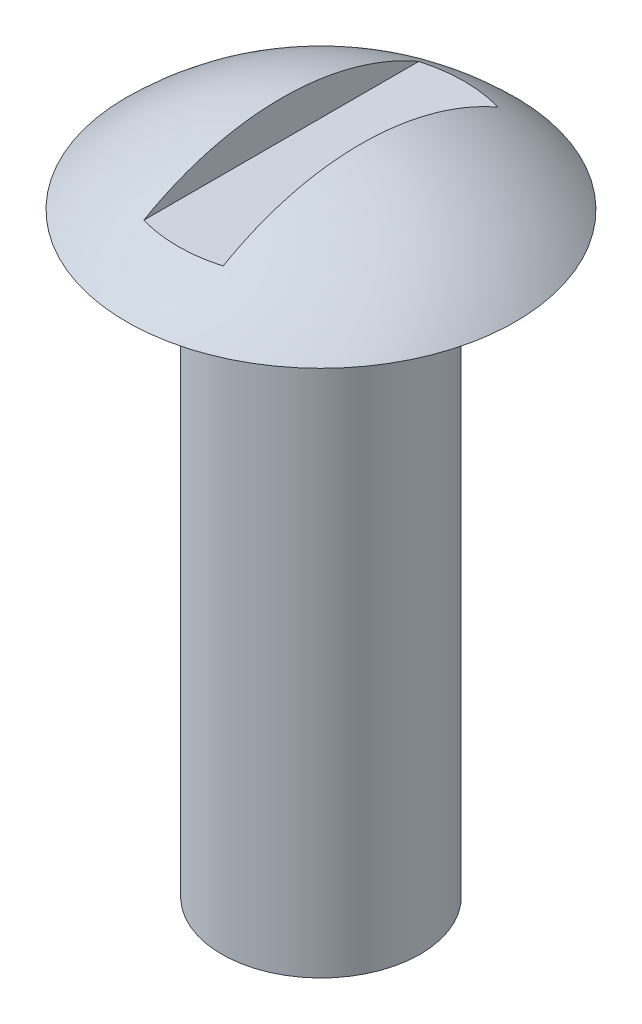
ISO-10303-21;
HEADER;
FILE_DESCRIPTION(('STEP AP214'),'2;1');
FILE_NAME('part.step','',(''),(''),'','','');
FILE_SCHEMA(('AUTOMOTIVE_DESIGN { 1 0 10303 214 1 1 1 1 }'));
ENDSEC;
DATA;
#1=APPLICATION_CONTEXT('core data for automotive mechanical design processes');
#2=APPLICATION_PROTOCOL_DEFINITION('international standard','automotive_design',2000,#1);
#3=PRODUCT_CONTEXT('',#1,'mechanical');
#4=PRODUCT('Part','Part','',(#3));
#5=PRODUCT_RELATED_PRODUCT_CATEGORY('part','',(#4));
#6=PRODUCT_DEFINITION_FORMATION('','',#4);
#7=PRODUCT_DEFINITION_CONTEXT('part definition',#1,'design');
#8=PRODUCT_DEFINITION('design','',#6,#7);
#9=PRODUCT_DEFINITION_SHAPE('','',#8);
#10=(LENGTH_UNIT() NAMED_UNIT(*) SI_UNIT(.MILLI.,.METRE.));
#11=(NAMED_UNIT(*) PLANE_ANGLE_UNIT() SI_UNIT($,.RADIAN.));
#12=(NAMED_UNIT(*) SI_UNIT($,.STERADIAN.) SOLID_ANGLE_UNIT());
#13=UNCERTAINTY_MEASURE_WITH_UNIT(LENGTH_MEASURE(1.E-05),#10,'distance_accuracy_value','');
#14=(GEOMETRIC_REPRESENTATION_CONTEXT(3) GLOBAL_UNCERTAINTY_ASSIGNED_CONTEXT((#13)) GLOBAL_UNIT_ASSIGNED_CONTEXT((#10,
#11,#12)) REPRESENTATION_CONTEXT('',''));
#15=CARTESIAN_POINT('',(0.,0.,0.));
#16=DIRECTION('',(0.,0.,1.));
#17=DIRECTION('',(1.,0.,0.));
#18=AXIS2_PLACEMENT_3D('',#15,#16,#17);
#19=CARTESIAN_POINT('',(-2.5,0.,0.));
#20=DIRECTION('',(0.,1.,0.));
#21=DIRECTION('',(-1.,0.,0.));
#22=AXIS2_PLACEMENT_3D('',#19,#20,#21);
#23=PLANE('',#22);
#24=CARTESIAN_POINT('',(-2.5,0.,0.));
#25=DIRECTION('',(0.,1.,0.));
#26=DIRECTION('',(-1.,0.,0.));
#27=AXIS2_PLACEMENT_3D('',#24,#25,#26);
#28=CIRCLE('',#27,2.5);
#29=CARTESIAN_POINT('',(-4.99999999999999,0.,0.));
#30=VERTEX_POINT('',#29);
#31=EDGE_CURVE('E72',#30,#30,#28,.T.);
#32=ORIENTED_EDGE('',*,*,#31,.F.);
#33=EDGE_LOOP('',(#32));
#34=FACE_BOUND('',#33,.T.);
#35=ADVANCED_FACE('F33',(#34),#23,.F.);
#36=CARTESIAN_POINT('',(-2.5,24.7117142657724,0.));
#37=DIRECTION('',(0.,1.,0.));
#38=DIRECTION('',(-1.,0.,0.));
#39=AXIS2_PLACEMENT_3D('',#36,#37,#38);
#40=CYLINDRICAL_SURFACE('',#39,2.5);
#41=CARTESIAN_POINT('',(-2.5,15.,0.));
#42=DIRECTION('',(0.,1.,0.));
#43=DIRECTION('',(-1.,0.,0.));
#44=AXIS2_PLACEMENT_3D('',#41,#42,#43);
#45=CIRCLE('',#44,2.5);
#46=CARTESIAN_POINT('',(-5.,15.,0.));
#47=VERTEX_POINT('',#46);
#48=EDGE_CURVE('E76',#47,#47,#45,.T.);
#49=ORIENTED_EDGE('',*,*,#48,.F.);
#50=EDGE_LOOP('',(#49));
#51=FACE_BOUND('',#50,.T.);
#52=ORIENTED_EDGE('',*,*,#31,.T.);
#53=EDGE_LOOP('',(#52));
#54=FACE_BOUND('',#53,.T.);
#55=ADVANCED_FACE('F86',(#51,#54),#40,.T.);
#56=CARTESIAN_POINT('',(0.,15.,0.));
#57=DIRECTION('',(0.,1.,0.));
#58=DIRECTION('',(-1.,0.,0.));
#59=AXIS2_PLACEMENT_3D('',#56,#57,#58);
#60=PLANE('',#59);
#61=CARTESIAN_POINT('',(-2.5,15.,0.));
#62=DIRECTION('',(0.,1.,0.));
#63=DIRECTION('',(-1.,0.,0.));
#64=AXIS2_PLACEMENT_3D('',#61,#62,#63);
#65=CIRCLE('',#64,4.89897948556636);
#66=CARTESIAN_POINT('',(-7.39897948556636,15.,0.));
#67=VERTEX_POINT('',#66);
#68=EDGE_CURVE('E68',#67,#67,#65,.T.);
#69=ORIENTED_EDGE('',*,*,#68,.F.);
#70=EDGE_LOOP('',(#69));
#71=FACE_BOUND('',#70,.T.);
#72=ORIENTED_EDGE('',*,*,#48,.T.);
#73=EDGE_LOOP('',(#72));
#74=FACE_BOUND('',#73,.T.);
#75=ADVANCED_FACE('F83',(#71,#74),#60,.F.);
#76=CARTESIAN_POINT('',(-2.5,10.,0.));
#77=DIRECTION('',(0.,1.,0.));
#78=DIRECTION('',(1.,0.,0.));
#79=AXIS2_PLACEMENT_3D('',#76,#77,#78);
#80=SPHERICAL_SURFACE('',#79,7.);
#81=CARTESIAN_POINT('',(-1.5,10.,0.));
#82=DIRECTION('',(1.,0.,0.));
#83=DIRECTION('',(0.,1.,0.));
#84=AXIS2_PLACEMENT_3D('',#81,#82,#83);
#85=CIRCLE('',#84,6.92820323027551);
#86=CARTESIAN_POINT('',(-1.5,16.,-3.46410161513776));
#87=VERTEX_POINT('',#86);
#88=CARTESIAN_POINT('',(-1.5,16.,3.46410161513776));
#89=VERTEX_POINT('',#88);
#90=EDGE_CURVE('E66',#87,#89,#85,.T.);
#91=ORIENTED_EDGE('',*,*,#90,.T.);
#92=CARTESIAN_POINT('',(-2.5,16.,0.));
#93=DIRECTION('',(0.,-1.,0.));
#94=DIRECTION('',(0.,0.,-1.));
#95=AXIS2_PLACEMENT_3D('',#92,#93,#94);
#96=CIRCLE('',#95,3.60555127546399);
#97=CARTESIAN_POINT('',(-3.5,16.,3.46410161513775));
#98=VERTEX_POINT('',#97);
#99=EDGE_CURVE('E11',#89,#98,#96,.T.);
#100=ORIENTED_EDGE('',*,*,#99,.T.);
#101=CARTESIAN_POINT('',(-3.5,10.,0.));
#102=DIRECTION('',(-1.,0.,0.));
#103=DIRECTION('',(0.,-1.,0.));
#104=AXIS2_PLACEMENT_3D('',#101,#102,#103);
#105=CIRCLE('',#104,6.92820323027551);
#106=CARTESIAN_POINT('',(-3.5,16.,-3.46410161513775));
#107=VERTEX_POINT('',#106);
#108=EDGE_CURVE('E36',#98,#107,#105,.T.);
#109=ORIENTED_EDGE('',*,*,#108,.T.);
#110=EDGE_CURVE('E42',#107,#87,#96,.T.);
#111=ORIENTED_EDGE('',*,*,#110,.T.);
#112=EDGE_LOOP('',(#91,#100,#109,#111));
#113=FACE_BOUND('',#112,.T.);
#114=ORIENTED_EDGE('',*,*,#68,.T.);
#115=EDGE_LOOP('',(#114));
#116=FACE_BOUND('',#115,.T.);
#117=ADVANCED_FACE('F70',(#113,#116),#80,.T.);
#118=CARTESIAN_POINT('',(-3.5,24.0065265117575,-4.89897948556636));
#119=DIRECTION('',(-1.,0.,0.));
#120=DIRECTION('',(0.,-1.,0.));
#121=AXIS2_PLACEMENT_3D('',#118,#119,#120);
#122=PLANE('',#121);
#123=DIRECTION('',(0.,0.,1.));
#124=VECTOR('',#123,1.);
#125=CARTESIAN_POINT('',(-3.5,16.,-4.89897948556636));
#126=LINE('',#125,#124);
#127=EDGE_CURVE('E61',#107,#98,#126,.T.);
#128=ORIENTED_EDGE('',*,*,#127,.F.);
#129=ORIENTED_EDGE('',*,*,#108,.F.);
#130=EDGE_LOOP('',(#128,#129));
#131=FACE_BOUND('',#130,.T.);
#132=ADVANCED_FACE('F111',(#131),#122,.F.);
#133=CARTESIAN_POINT('',(-1.5,24.0065265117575,-4.89897948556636));
#134=DIRECTION('',(1.,0.,0.));
#135=DIRECTION('',(0.,1.,0.));
#136=AXIS2_PLACEMENT_3D('',#133,#134,#135);
#137=PLANE('',#136);
#138=DIRECTION('',(0.,0.,1.));
#139=VECTOR('',#138,1.);
#140=CARTESIAN_POINT('',(-1.5,16.,-4.89897948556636));
#141=LINE('',#140,#139);
#142=EDGE_CURVE('E49',#87,#89,#141,.T.);
#143=ORIENTED_EDGE('',*,*,#142,.T.);
#144=ORIENTED_EDGE('',*,*,#90,.F.);
#145=EDGE_LOOP('',(#143,#144));
#146=FACE_BOUND('',#145,.T.);
#147=ADVANCED_FACE('F65',(#146),#137,.F.);
#148=CARTESIAN_POINT('',(-3.5,16.,-4.89897948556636));
#149=DIRECTION('',(0.,-1.,0.));
#150=DIRECTION('',(0.,0.,-1.));
#151=AXIS2_PLACEMENT_3D('',#148,#149,#150);
#152=PLANE('',#151);
#153=ORIENTED_EDGE('',*,*,#142,.F.);
#154=ORIENTED_EDGE('',*,*,#110,.F.);
#155=ORIENTED_EDGE('',*,*,#127,.T.);
#156=ORIENTED_EDGE('',*,*,#99,.F.);
#157=EDGE_LOOP('',(#153,#154,#155,#156));
#158=FACE_BOUND('',#157,.T.);
#159=ADVANCED_FACE('F60',(#158),#152,.F.);
#160=CLOSED_SHELL('',(#35,#55,#75,#117,#132,#147,#159));
#161=MANIFOLD_SOLID_BREP('B2',#160);
#162=ADVANCED_BREP_SHAPE_REPRESENTATION('',(#18,#161),#14);
#163=SHAPE_DEFINITION_REPRESENTATION(#9,#162);
ENDSEC;
END-ISO-10303-21;
